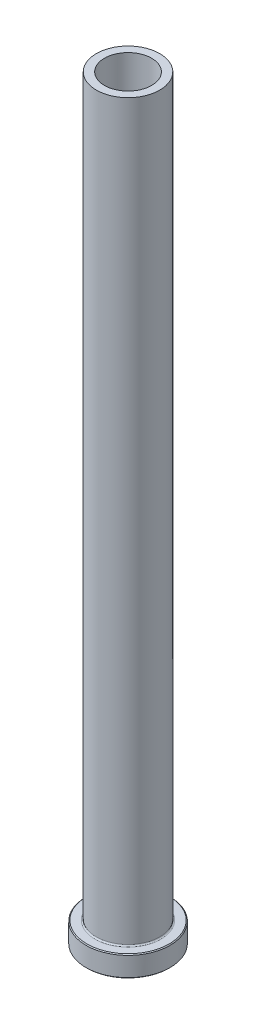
ISO-10303-21;
HEADER;
FILE_DESCRIPTION(('STEP AP214'),'2;1');
FILE_NAME('part.step','',(''),(''),'','','');
FILE_SCHEMA(('AUTOMOTIVE_DESIGN { 1 0 10303 214 1 1 1 1 }'));
ENDSEC;
DATA;
#1=APPLICATION_CONTEXT('core data for automotive mechanical design processes');
#2=APPLICATION_PROTOCOL_DEFINITION('international standard','automotive_design',2000,#1);
#3=PRODUCT_CONTEXT('',#1,'mechanical');
#4=PRODUCT('Part','Part','',(#3));
#5=PRODUCT_RELATED_PRODUCT_CATEGORY('part','',(#4));
#6=PRODUCT_DEFINITION_FORMATION('','',#4);
#7=PRODUCT_DEFINITION_CONTEXT('part definition',#1,'design');
#8=PRODUCT_DEFINITION('design','',#6,#7);
#9=PRODUCT_DEFINITION_SHAPE('','',#8);
#10=(LENGTH_UNIT() NAMED_UNIT(*) SI_UNIT(.MILLI.,.METRE.));
#11=(NAMED_UNIT(*) PLANE_ANGLE_UNIT() SI_UNIT($,.RADIAN.));
#12=(NAMED_UNIT(*) SI_UNIT($,.STERADIAN.) SOLID_ANGLE_UNIT());
#13=UNCERTAINTY_MEASURE_WITH_UNIT(LENGTH_MEASURE(1.E-05),#10,'distance_accuracy_value','');
#14=(GEOMETRIC_REPRESENTATION_CONTEXT(3) GLOBAL_UNCERTAINTY_ASSIGNED_CONTEXT((#13)) GLOBAL_UNIT_ASSIGNED_CONTEXT((#10,
#11,#12)) REPRESENTATION_CONTEXT('',''));
#15=CARTESIAN_POINT('',(0.,0.,0.));
#16=DIRECTION('',(0.,0.,1.));
#17=DIRECTION('',(1.,0.,0.));
#18=AXIS2_PLACEMENT_3D('',#15,#16,#17);
#19=CARTESIAN_POINT('',(0.,0.,0.));
#20=DIRECTION('',(0.,-1.,0.));
#21=DIRECTION('',(0.,0.,-1.));
#22=AXIS2_PLACEMENT_3D('',#19,#20,#21);
#23=PLANE('',#22);
#24=CARTESIAN_POINT('',(0.,0.,0.));
#25=DIRECTION('',(0.,-1.,0.));
#26=DIRECTION('',(0.,0.,-1.));
#27=AXIS2_PLACEMENT_3D('',#24,#25,#26);
#28=CIRCLE('',#27,12.446);
#29=CARTESIAN_POINT('',(0.,0.,-12.446));
#30=VERTEX_POINT('',#29);
#31=EDGE_CURVE('E44',#30,#30,#28,.T.);
#32=ORIENTED_EDGE('',*,*,#31,.T.);
#33=EDGE_LOOP('',(#32));
#34=FACE_BOUND('',#33,.T.);
#35=CARTESIAN_POINT('',(0.,0.,0.));
#36=DIRECTION('',(0.,-1.,0.));
#37=DIRECTION('',(0.,0.,-1.));
#38=AXIS2_PLACEMENT_3D('',#35,#36,#37);
#39=CIRCLE('',#38,8.52487500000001);
#40=CARTESIAN_POINT('',(0.,0.,-8.52487500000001));
#41=VERTEX_POINT('',#40);
#42=EDGE_CURVE('E58',#41,#41,#39,.T.);
#43=ORIENTED_EDGE('',*,*,#42,.F.);
#44=EDGE_LOOP('',(#43));
#45=FACE_BOUND('',#44,.T.);
#46=ADVANCED_FACE('F29',(#34,#45),#23,.T.);
#47=CARTESIAN_POINT('',(0.,0.,0.));
#48=DIRECTION('',(0.,-1.,0.));
#49=DIRECTION('',(0.,0.,-1.));
#50=AXIS2_PLACEMENT_3D('',#47,#48,#49);
#51=CYLINDRICAL_SURFACE('',#50,12.7);
#52=CARTESIAN_POINT('',(0.,0.254000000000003,0.));
#53=DIRECTION('',(0.,-1.,0.));
#54=DIRECTION('',(0.,0.,-1.));
#55=AXIS2_PLACEMENT_3D('',#52,#53,#54);
#56=CIRCLE('',#55,12.7);
#57=CARTESIAN_POINT('',(0.,0.254000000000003,-12.7));
#58=VERTEX_POINT('',#57);
#59=EDGE_CURVE('E36',#58,#58,#56,.F.);
#60=ORIENTED_EDGE('',*,*,#59,.T.);
#61=EDGE_LOOP('',(#60));
#62=FACE_BOUND('',#61,.T.);
#63=CARTESIAN_POINT('',(0.,6.09599999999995,0.));
#64=DIRECTION('',(0.,1.,0.));
#65=DIRECTION('',(0.,0.,1.));
#66=AXIS2_PLACEMENT_3D('',#63,#64,#65);
#67=CIRCLE('',#66,12.7);
#68=CARTESIAN_POINT('',(0.,6.09599999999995,12.7));
#69=VERTEX_POINT('',#68);
#70=EDGE_CURVE('E40',#69,#69,#67,.F.);
#71=ORIENTED_EDGE('',*,*,#70,.T.);
#72=EDGE_LOOP('',(#71));
#73=FACE_BOUND('',#72,.T.);
#74=ADVANCED_FACE('F103',(#62,#73),#51,.T.);
#75=CARTESIAN_POINT('',(12.7,6.35,0.));
#76=DIRECTION('',(0.,1.,0.));
#77=DIRECTION('',(0.,0.,1.));
#78=AXIS2_PLACEMENT_3D('',#75,#76,#77);
#79=PLANE('',#78);
#80=CARTESIAN_POINT('',(0.,6.35,0.));
#81=DIRECTION('',(0.,1.,0.));
#82=DIRECTION('',(0.,0.,1.));
#83=AXIS2_PLACEMENT_3D('',#80,#81,#82);
#84=CIRCLE('',#83,12.446);
#85=CARTESIAN_POINT('',(0.,6.35,12.446));
#86=VERTEX_POINT('',#85);
#87=EDGE_CURVE('E10',#86,#86,#84,.T.);
#88=ORIENTED_EDGE('',*,*,#87,.T.);
#89=EDGE_LOOP('',(#88));
#90=FACE_BOUND('',#89,.T.);
#91=CARTESIAN_POINT('',(0.,6.35,0.));
#92=DIRECTION('',(0.,-1.,0.));
#93=DIRECTION('',(0.,0.,-1.));
#94=AXIS2_PLACEMENT_3D('',#91,#92,#93);
#95=CIRCLE('',#94,9.979025);
#96=CARTESIAN_POINT('',(0.,6.35,-9.979025));
#97=VERTEX_POINT('',#96);
#98=EDGE_CURVE('E49',#97,#97,#95,.T.);
#99=ORIENTED_EDGE('',*,*,#98,.T.);
#100=EDGE_LOOP('',(#99));
#101=FACE_BOUND('',#100,.T.);
#102=ADVANCED_FACE('F109',(#90,#101),#79,.T.);
#103=CARTESIAN_POINT('',(0.,6.746875,0.));
#104=DIRECTION('',(0.,-1.,0.));
#105=DIRECTION('',(0.,0.,-1.));
#106=AXIS2_PLACEMENT_3D('',#103,#104,#105);
#107=TOROIDAL_SURFACE('',#106,9.979025,0.396875);
#108=CARTESIAN_POINT('',(0.,6.746875,0.));
#109=DIRECTION('',(0.,-1.,0.));
#110=DIRECTION('',(0.,0.,-1.));
#111=AXIS2_PLACEMENT_3D('',#108,#109,#110);
#112=CIRCLE('',#111,9.58215);
#113=CARTESIAN_POINT('',(0.,6.746875,-9.58215));
#114=VERTEX_POINT('',#113);
#115=EDGE_CURVE('E52',#114,#114,#112,.T.);
#116=ORIENTED_EDGE('',*,*,#115,.T.);
#117=EDGE_LOOP('',(#116));
#118=FACE_BOUND('',#117,.T.);
#119=ORIENTED_EDGE('',*,*,#98,.F.);
#120=EDGE_LOOP('',(#119));
#121=FACE_BOUND('',#120,.T.);
#122=ADVANCED_FACE('F139',(#118,#121),#107,.F.);
#123=CARTESIAN_POINT('',(0.,0.,0.));
#124=DIRECTION('',(0.,-1.,0.));
#125=DIRECTION('',(0.,0.,-1.));
#126=AXIS2_PLACEMENT_3D('',#123,#124,#125);
#127=CYLINDRICAL_SURFACE('',#126,9.58215);
#128=CARTESIAN_POINT('',(0.,228.6,0.));
#129=DIRECTION('',(0.,-1.,0.));
#130=DIRECTION('',(0.,0.,-1.));
#131=AXIS2_PLACEMENT_3D('',#128,#129,#130);
#132=CIRCLE('',#131,9.58215);
#133=CARTESIAN_POINT('',(0.,228.6,-9.58215));
#134=VERTEX_POINT('',#133);
#135=EDGE_CURVE('E55',#134,#134,#132,.T.);
#136=ORIENTED_EDGE('',*,*,#135,.T.);
#137=EDGE_LOOP('',(#136));
#138=FACE_BOUND('',#137,.T.);
#139=ORIENTED_EDGE('',*,*,#115,.F.);
#140=EDGE_LOOP('',(#139));
#141=FACE_BOUND('',#140,.T.);
#142=ADVANCED_FACE('F182',(#138,#141),#127,.T.);
#143=CARTESIAN_POINT('',(9.58215,228.6,0.));
#144=DIRECTION('',(0.,1.,0.));
#145=DIRECTION('',(0.,0.,1.));
#146=AXIS2_PLACEMENT_3D('',#143,#144,#145);
#147=PLANE('',#146);
#148=CARTESIAN_POINT('',(0.,228.6,0.));
#149=DIRECTION('',(0.,-1.,0.));
#150=DIRECTION('',(0.,0.,-1.));
#151=AXIS2_PLACEMENT_3D('',#148,#149,#150);
#152=CIRCLE('',#151,7.14375);
#153=CARTESIAN_POINT('',(0.,228.6,-7.14375));
#154=VERTEX_POINT('',#153);
#155=EDGE_CURVE('E70',#154,#154,#152,.T.);
#156=ORIENTED_EDGE('',*,*,#155,.T.);
#157=EDGE_LOOP('',(#156));
#158=FACE_BOUND('',#157,.T.);
#159=ORIENTED_EDGE('',*,*,#135,.F.);
#160=EDGE_LOOP('',(#159));
#161=FACE_BOUND('',#160,.T.);
#162=ADVANCED_FACE('F74',(#158,#161),#147,.T.);
#163=CARTESIAN_POINT('',(0.,0.,0.));
#164=DIRECTION('',(0.,-1.,0.));
#165=DIRECTION('',(0.,0.,-1.));
#166=AXIS2_PLACEMENT_3D('',#163,#164,#165);
#167=CONICAL_SURFACE('',#166,8.52487500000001,0.785398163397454);
#168=CARTESIAN_POINT('',(0.,0.396875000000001,0.));
#169=DIRECTION('',(0.,-1.,0.));
#170=DIRECTION('',(0.,0.,-1.));
#171=AXIS2_PLACEMENT_3D('',#168,#169,#170);
#172=CIRCLE('',#171,8.128);
#173=CARTESIAN_POINT('',(0.,0.396875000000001,-8.128));
#174=VERTEX_POINT('',#173);
#175=EDGE_CURVE('E61',#174,#174,#172,.T.);
#176=ORIENTED_EDGE('',*,*,#175,.F.);
#177=EDGE_LOOP('',(#176));
#178=FACE_BOUND('',#177,.T.);
#179=ORIENTED_EDGE('',*,*,#42,.T.);
#180=EDGE_LOOP('',(#179));
#181=FACE_BOUND('',#180,.T.);
#182=ADVANCED_FACE('F93',(#178,#181),#167,.F.);
#183=CARTESIAN_POINT('',(0.,0.,0.));
#184=DIRECTION('',(0.,-1.,0.));
#185=DIRECTION('',(0.,0.,-1.));
#186=AXIS2_PLACEMENT_3D('',#183,#184,#185);
#187=CYLINDRICAL_SURFACE('',#186,8.128);
#188=CARTESIAN_POINT('',(0.,154.1145,0.));
#189=DIRECTION('',(0.,-1.,0.));
#190=DIRECTION('',(0.,0.,-1.));
#191=AXIS2_PLACEMENT_3D('',#188,#189,#190);
#192=CIRCLE('',#191,8.128);
#193=CARTESIAN_POINT('',(0.,154.1145,-8.128));
#194=VERTEX_POINT('',#193);
#195=EDGE_CURVE('E64',#194,#194,#192,.T.);
#196=ORIENTED_EDGE('',*,*,#195,.F.);
#197=EDGE_LOOP('',(#196));
#198=FACE_BOUND('',#197,.T.);
#199=ORIENTED_EDGE('',*,*,#175,.T.);
#200=EDGE_LOOP('',(#199));
#201=FACE_BOUND('',#200,.T.);
#202=ADVANCED_FACE('F87',(#198,#201),#187,.F.);
#203=CARTESIAN_POINT('',(0.,154.1145,0.));
#204=DIRECTION('',(0.,-1.,0.));
#205=DIRECTION('',(0.,0.,-1.));
#206=AXIS2_PLACEMENT_3D('',#203,#204,#205);
#207=CONICAL_SURFACE('',#206,8.128,0.0687802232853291);
#208=CARTESIAN_POINT('',(0.,168.402,0.));
#209=DIRECTION('',(0.,-1.,0.));
#210=DIRECTION('',(0.,0.,-1.));
#211=AXIS2_PLACEMENT_3D('',#208,#209,#210);
#212=CIRCLE('',#211,7.14375);
#213=CARTESIAN_POINT('',(0.,168.402,-7.14375));
#214=VERTEX_POINT('',#213);
#215=EDGE_CURVE('E67',#214,#214,#212,.T.);
#216=ORIENTED_EDGE('',*,*,#215,.F.);
#217=EDGE_LOOP('',(#216));
#218=FACE_BOUND('',#217,.T.);
#219=ORIENTED_EDGE('',*,*,#195,.T.);
#220=EDGE_LOOP('',(#219));
#221=FACE_BOUND('',#220,.T.);
#222=ADVANCED_FACE('F81',(#218,#221),#207,.F.);
#223=CARTESIAN_POINT('',(0.,0.,0.));
#224=DIRECTION('',(0.,-1.,0.));
#225=DIRECTION('',(0.,0.,-1.));
#226=AXIS2_PLACEMENT_3D('',#223,#224,#225);
#227=CYLINDRICAL_SURFACE('',#226,7.14375);
#228=ORIENTED_EDGE('',*,*,#155,.F.);
#229=EDGE_LOOP('',(#228));
#230=FACE_BOUND('',#229,.T.);
#231=ORIENTED_EDGE('',*,*,#215,.T.);
#232=EDGE_LOOP('',(#231));
#233=FACE_BOUND('',#232,.T.);
#234=ADVANCED_FACE('F77',(#230,#233),#227,.F.);
#235=CARTESIAN_POINT('',(0.,0.,0.));
#236=DIRECTION('',(0.,1.,0.));
#237=DIRECTION('',(0.,0.,1.));
#238=AXIS2_PLACEMENT_3D('',#235,#236,#237);
#239=CONICAL_SURFACE('',#238,12.446,0.785398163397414);
#240=ORIENTED_EDGE('',*,*,#59,.F.);
#241=EDGE_LOOP('',(#240));
#242=FACE_BOUND('',#241,.T.);
#243=ORIENTED_EDGE('',*,*,#31,.F.);
#244=EDGE_LOOP('',(#243));
#245=FACE_BOUND('',#244,.T.);
#246=ADVANCED_FACE('F80',(#242,#245),#239,.T.);
#247=CARTESIAN_POINT('',(0.,6.09599999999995,0.));
#248=DIRECTION('',(0.,-1.,0.));
#249=DIRECTION('',(0.,0.,-1.));
#250=AXIS2_PLACEMENT_3D('',#247,#248,#249);
#251=CONICAL_SURFACE('',#250,12.7,0.78539816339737);
#252=ORIENTED_EDGE('',*,*,#87,.F.);
#253=EDGE_LOOP('',(#252));
#254=FACE_BOUND('',#253,.T.);
#255=ORIENTED_EDGE('',*,*,#70,.F.);
#256=EDGE_LOOP('',(#255));
#257=FACE_BOUND('',#256,.T.);
#258=ADVANCED_FACE('F31',(#254,#257),#251,.T.);
#259=CLOSED_SHELL('',(#46,#74,#102,#122,#142,#162,#182,#202,#222,#234,#246,#258));
#260=MANIFOLD_SOLID_BREP('B2',#259);
#261=ADVANCED_BREP_SHAPE_REPRESENTATION('',(#18,#260),#14);
#262=SHAPE_DEFINITION_REPRESENTATION(#9,#261);
ENDSEC;
END-ISO-10303-21;
